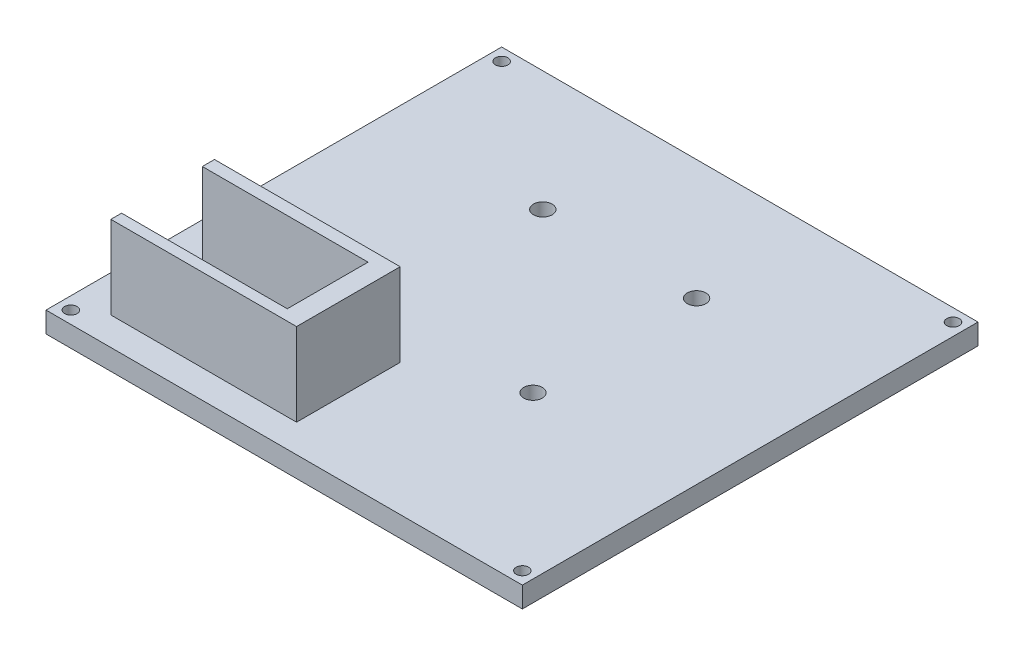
from build123d import *

# Parameters (mm, degrees)
SKETCH1_W           = 115
SKETCH1_H           = 110
SKETCH1_R           = 1.5
BOSS_EXTRUDE1_DEPTH = 5
SKETCH4_W           = 40
SKETCH4_H           = 2.928269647
SKETCH4_H_2         = 2.59374547
BOSS_EXTRUDE3_DEPTH = 20
SKETCH4_8_R         = 2.25
CUT_EXTRUDE1_DEPTH  = 5


with BuildPart() as part:
    # Sketch1 → Boss-Extrude1 (new body)
    with BuildSketch(Plane(origin=(0, 0, 0), x_dir=(1, 0, 0), z_dir=(0, 1, 0))):
        with Locations((-8.316561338, -18.5729224)):
            Rectangle(SKETCH1_W, SKETCH1_H)
        with Locations(Location((-62.816561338, 33.4270776, 0), (0, 0, 270))):
            Circle(SKETCH1_R, mode=Mode.SUBTRACT)
        with Locations(Location((46.183438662, 33.394052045, 0), (0, 0, 270))):
            Circle(SKETCH1_R, mode=Mode.SUBTRACT)
        with Locations(Location((-62.816561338, -70.5729224, 0), (0, 0, 270))):
            Circle(SKETCH1_R, mode=Mode.SUBTRACT)
        with Locations(Location((46.183438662, -70.5729224, 0), (0, 0, 270))):
            Circle(SKETCH1_R, mode=Mode.SUBTRACT)
    extrude(amount=BOSS_EXTRUDE1_DEPTH)

    # Sketch4 → Boss-Extrude3 (add)
    with BuildSketch(Plane(origin=(0, 5, 0), x_dir=(1, 0, 0), z_dir=(0, 1, 0))):
        with Locations((-36.96183969, -43.217588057)):
            Rectangle(SKETCH4_W, SKETCH4_H)
        Polygon((-12.125133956, -41.753453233), (-12.125133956, -66.77546835), (-16.96183969, -66.77546835), (-16.96183969, -64.18172288), (-16.96183969, -44.68172288), (-16.96183969, -41.753453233), align=None)
        with Locations((-36.96183969, -65.478595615)):
            Rectangle(SKETCH4_W, SKETCH4_H_2)
    extrude(amount=BOSS_EXTRUDE3_DEPTH)

    # Sketch4_8 → Cut-Extrude1 (cut)
    with BuildSketch(Plane(origin=(0, 5, 0), x_dir=(1, 0, 0), z_dir=(0, 1, 0))):
        with Locations(Location((-26.882599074, -32.0729224, 0), (0, 0, 270))):
            Circle(SKETCH4_8_R)
        with Locations(Location((10.253438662, 7.4270776, 0), (0, 0, 270))):
            Circle(SKETCH4_8_R)
        with Locations(Location((-26.882599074, 7.4270776, 0), (0, 0, 270))):
            Circle(SKETCH4_8_R)
        with Locations(Location((10.253438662, -32.0729224, 0), (0, 0, 270))):
            Circle(SKETCH4_8_R)
    extrude(amount=-CUT_EXTRUDE1_DEPTH, mode=Mode.SUBTRACT)


solid = part.part
